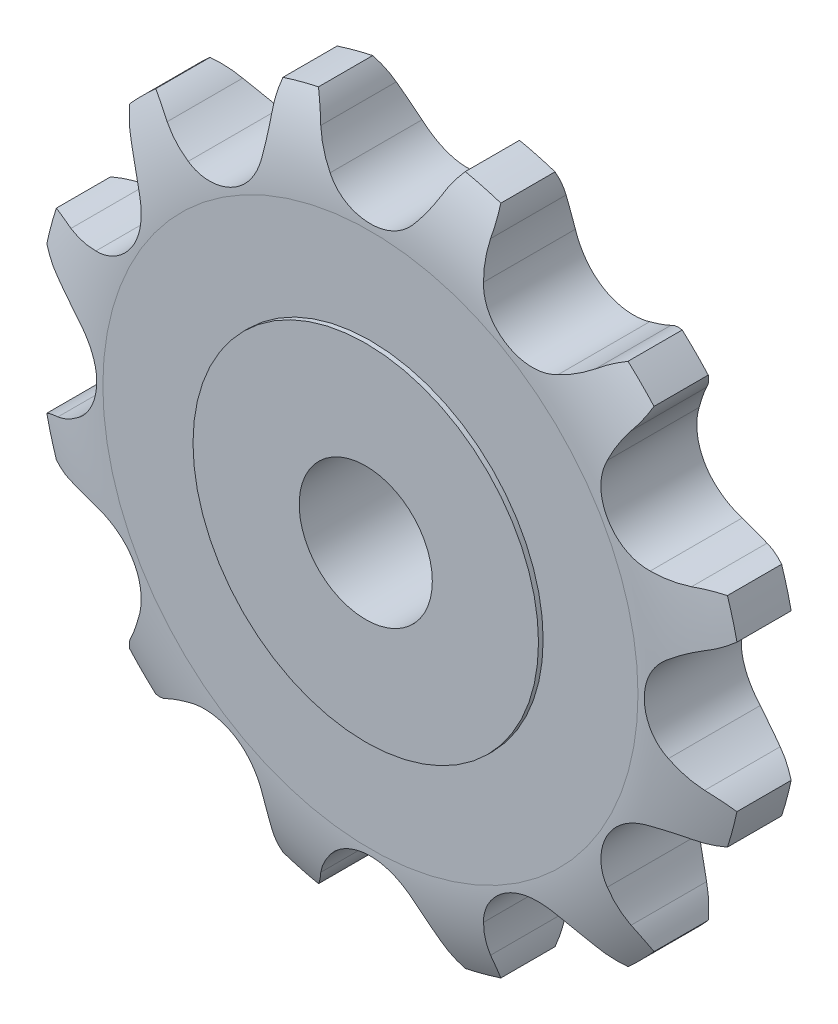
from build123d import *

# Parameters (mm, degrees)
MOVE_BODY_1_ANGLE        = 90
CUT_EXTRUDE_1_DEPTH      = 38.68952109
CUT_EXTRUDE_1_DEPTH_BACK = 38.68952109


with BuildPart() as part:
    # Sketch 2 → Revolve 1 (revolve)
    with BuildSketch(Plane.XY, mode=Mode.PRIVATE) as revolve_1_sk:
        with BuildLine():
            Line((-3.65, 20.1), (-3.65, 12.976969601))
            Line((-3.65, 12.976969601), (-4, 12.976969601))
            Line((-4, 12.976969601), (-4, 5))
            Line((-4, 5), (4, 5))
            Line((4, 5), (4, 12.976969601))
            Line((4, 12.976969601), (3.65, 12.976969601))
            Line((3.65, 12.976969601), (3.65, 20.1))
            ThreePointArc((3.65, 20.1), (3.240423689, 23.400122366), (2.036547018, 26.5))
            Line((2.036547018, 26.5), (-2.036547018, 26.5))
            ThreePointArc((-2.036547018, 26.5), (-3.240423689, 23.400122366), (-3.65, 20.1))
        make_face()
    revolve(revolve_1_sk.sketch.rotate(Axis((-9, 0, 0), (1, 0, 0)), 90), axis=Axis((-9, 0, 0), (1, 0, 0)))


with BuildPart() as part_1:
    # Move Body 1: moved
    add(part.part.rotate(Axis((0, 0, 0), (0, 1, 0)), MOVE_BODY_1_ANGLE))

    # Sketch 5 → Cut-Extrude 1 (cut, two sides: drawn at the far end of the back side and taken through both)
    with BuildSketch(Plane.XY.offset(-CUT_EXTRUDE_1_DEPTH_BACK)):
        with BuildLine():
            ThreePointArc((-24.292819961, -4.543187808), (-23.196760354, -3.947791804), (-22.180032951, -3.22522108))
            ThreePointArc((-22.180032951, -3.22522108), (-20.565, 0), (-22.180032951, 3.22522108))
            ThreePointArc((-22.180032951, 3.22522108), (-23.196760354, 3.947791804), (-24.292819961, 4.543187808))
            ThreePointArc((-24.292819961, 4.543187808), (-25.140993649, 4.970407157), (-25.920104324, 5.513455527))
            ThreePointArc((-25.920104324, 5.513455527), (-26.5, 0), (-25.920104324, -5.513455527))
            ThreePointArc((-25.920104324, -5.513455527), (-25.140993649, -4.970407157), (-24.292819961, -4.543187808))
        make_face()
        with BuildLine():
            ThreePointArc((22.180032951, -3.22522108), (23.196760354, -3.947791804), (24.292819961, -4.543187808))
            ThreePointArc((24.292819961, -4.543187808), (25.140993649, -4.970407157), (25.920104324, -5.513455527))
            ThreePointArc((25.920104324, -5.513455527), (26.5, 0), (25.920104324, 5.513455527))
            ThreePointArc((25.920104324, 5.513455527), (25.140993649, 4.970407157), (24.292819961, 4.543187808))
            ThreePointArc((24.292819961, 4.543187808), (23.196760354, 3.947791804), (22.180032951, 3.22522108))
            ThreePointArc((22.180032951, 3.22522108), (20.565, 0), (22.180032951, -3.22522108))
        make_face()
        with BuildLine():
            ThreePointArc((8.185259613, -25.204196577), (13.25, -22.9496732), (17.734844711, -19.69074105))
            ThreePointArc((17.734844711, -19.69074105), (16.874995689, -19.287535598), (16.080926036, -18.766605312))
            ThreePointArc((16.080926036, -18.766605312), (15.017268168, -18.11508785), (13.883139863, -17.595861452))
            ThreePointArc((13.883139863, -17.595861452), (10.2825, -17.809812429), (8.296893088, -20.821082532))
            ThreePointArc((8.296893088, -20.821082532), (8.179492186, -22.062879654), (8.211893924, -23.30979312))
            ThreePointArc((8.211893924, -23.30979312), (8.26599796, -24.257942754), (8.185259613, -25.204196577))
        make_face()
        with BuildLine():
            ThreePointArc((19.69074105, -17.734844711), (22.9496732, -13.25), (25.204196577, -8.185259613))
            ThreePointArc((25.204196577, -8.185259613), (24.257942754, -8.26599796), (23.30979312, -8.211893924))
            ThreePointArc((23.30979312, -8.211893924), (22.062879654, -8.179492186), (20.821082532, -8.296893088))
            ThreePointArc((20.821082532, -8.296893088), (17.809812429, -10.2825), (17.595861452, -13.883139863))
            ThreePointArc((17.595861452, -13.883139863), (18.11508785, -15.017268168), (18.766605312, -16.080926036))
            ThreePointArc((18.766605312, -16.080926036), (19.287535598, -16.874995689), (19.69074105, -17.734844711))
        make_face()
        with BuildLine():
            ThreePointArc((3.22522108, -22.180032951), (0, -20.565), (-3.22522108, -22.180032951))
            ThreePointArc((-3.22522108, -22.180032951), (-3.947791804, -23.196760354), (-4.543187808, -24.292819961))
            ThreePointArc((-4.543187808, -24.292819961), (-4.970407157, -25.140993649), (-5.513455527, -25.920104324))
            ThreePointArc((-5.513455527, -25.920104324), (0, -26.5), (5.513455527, -25.920104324))
            ThreePointArc((5.513455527, -25.920104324), (4.970407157, -25.140993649), (4.543187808, -24.292819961))
            ThreePointArc((4.543187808, -24.292819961), (3.947791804, -23.196760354), (3.22522108, -22.180032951))
        make_face()
        with BuildLine():
            ThreePointArc((-8.211893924, -23.30979312), (-8.26599796, -24.257942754), (-8.185259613, -25.204196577))
            ThreePointArc((-8.185259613, -25.204196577), (-13.25, -22.9496732), (-17.734844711, -19.69074105))
            ThreePointArc((-17.734844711, -19.69074105), (-16.874995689, -19.287535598), (-16.080926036, -18.766605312))
            ThreePointArc((-16.080926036, -18.766605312), (-15.017268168, -18.11508785), (-13.883139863, -17.595861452))
            ThreePointArc((-13.883139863, -17.595861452), (-10.2825, -17.809812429), (-8.296893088, -20.821082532))
            ThreePointArc((-8.296893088, -20.821082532), (-8.179492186, -22.062879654), (-8.211893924, -23.30979312))
        make_face()
        with BuildLine():
            ThreePointArc((-18.766605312, -16.080926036), (-18.11508785, -15.017268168), (-17.595861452, -13.883139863))
            ThreePointArc((-17.595861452, -13.883139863), (-17.809812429, -10.2825), (-20.821082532, -8.296893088))
            ThreePointArc((-20.821082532, -8.296893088), (-22.062879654, -8.179492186), (-23.30979312, -8.211893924))
            ThreePointArc((-23.30979312, -8.211893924), (-24.257942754, -8.26599796), (-25.204196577, -8.185259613))
            ThreePointArc((-25.204196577, -8.185259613), (-22.9496732, -13.25), (-19.69074105, -17.734844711))
            ThreePointArc((-19.69074105, -17.734844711), (-19.287535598, -16.874995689), (-18.766605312, -16.080926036))
        make_face()
        with BuildLine():
            ThreePointArc((25.204196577, 8.185259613), (22.9496732, 13.25), (19.69074105, 17.734844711))
            ThreePointArc((19.69074105, 17.734844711), (19.287535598, 16.874995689), (18.766605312, 16.080926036))
            ThreePointArc((18.766605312, 16.080926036), (18.11508785, 15.017268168), (17.595861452, 13.883139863))
            ThreePointArc((17.595861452, 13.883139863), (17.809812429, 10.2825), (20.821082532, 8.296893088))
            ThreePointArc((20.821082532, 8.296893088), (22.062879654, 8.179492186), (23.30979312, 8.211893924))
            ThreePointArc((23.30979312, 8.211893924), (24.257942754, 8.26599796), (25.204196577, 8.185259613))
        make_face()
        with BuildLine():
            ThreePointArc((17.734844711, 19.69074105), (13.25, 22.9496732), (8.185259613, 25.204196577))
            ThreePointArc((8.185259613, 25.204196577), (8.26599796, 24.257942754), (8.211893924, 23.30979312))
            ThreePointArc((8.211893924, 23.30979312), (8.179492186, 22.062879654), (8.296893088, 20.821082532))
            ThreePointArc((8.296893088, 20.821082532), (10.2825, 17.809812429), (13.883139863, 17.595861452))
            ThreePointArc((13.883139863, 17.595861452), (15.017268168, 18.11508785), (16.080926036, 18.766605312))
            ThreePointArc((16.080926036, 18.766605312), (16.874995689, 19.287535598), (17.734844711, 19.69074105))
        make_face()
        with BuildLine():
            ThreePointArc((5.513455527, 25.920104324), (0, 26.5), (-5.513455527, 25.920104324))
            ThreePointArc((-5.513455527, 25.920104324), (-4.970407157, 25.140993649), (-4.543187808, 24.292819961))
            ThreePointArc((-4.543187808, 24.292819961), (-3.947791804, 23.196760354), (-3.22522108, 22.180032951))
            ThreePointArc((-3.22522108, 22.180032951), (0, 20.565), (3.22522108, 22.180032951))
            ThreePointArc((3.22522108, 22.180032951), (3.947791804, 23.196760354), (4.543187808, 24.292819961))
            ThreePointArc((4.543187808, 24.292819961), (4.970407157, 25.140993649), (5.513455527, 25.920104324))
        make_face()
        with BuildLine():
            ThreePointArc((-8.185259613, 25.204196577), (-13.25, 22.9496732), (-17.734844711, 19.69074105))
            ThreePointArc((-17.734844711, 19.69074105), (-16.874995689, 19.287535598), (-16.080926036, 18.766605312))
            ThreePointArc((-16.080926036, 18.766605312), (-15.017268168, 18.11508785), (-13.883139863, 17.595861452))
            ThreePointArc((-13.883139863, 17.595861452), (-10.2825, 17.809812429), (-8.296893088, 20.821082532))
            ThreePointArc((-8.296893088, 20.821082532), (-8.179492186, 22.062879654), (-8.211893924, 23.30979312))
            ThreePointArc((-8.211893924, 23.30979312), (-8.26599796, 24.257942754), (-8.185259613, 25.204196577))
        make_face()
        with BuildLine():
            ThreePointArc((-19.69074105, 17.734844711), (-22.9496732, 13.25), (-25.204196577, 8.185259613))
            ThreePointArc((-25.204196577, 8.185259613), (-24.257942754, 8.26599796), (-23.30979312, 8.211893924))
            ThreePointArc((-23.30979312, 8.211893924), (-22.062879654, 8.179492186), (-20.821082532, 8.296893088))
            ThreePointArc((-20.821082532, 8.296893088), (-17.809812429, 10.2825), (-17.595861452, 13.883139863))
            ThreePointArc((-17.595861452, 13.883139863), (-18.11508785, 15.017268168), (-18.766605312, 16.080926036))
            ThreePointArc((-18.766605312, 16.080926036), (-19.287535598, 16.874995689), (-19.69074105, 17.734844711))
        make_face()
    extrude(amount=CUT_EXTRUDE_1_DEPTH + CUT_EXTRUDE_1_DEPTH_BACK, mode=Mode.SUBTRACT)


solid = part_1.part
